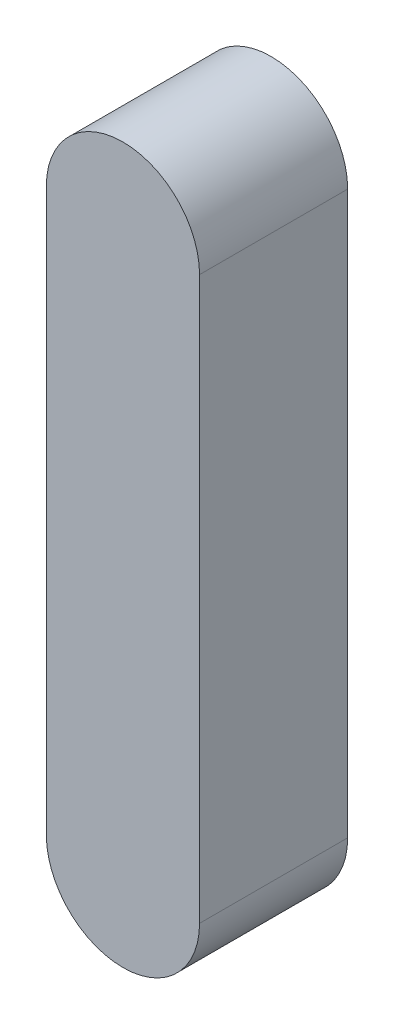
ISO-10303-21;
HEADER;
FILE_DESCRIPTION(('STEP AP214'),'2;1');
FILE_NAME('part.step','',(''),(''),'','','');
FILE_SCHEMA(('AUTOMOTIVE_DESIGN { 1 0 10303 214 1 1 1 1 }'));
ENDSEC;
DATA;
#1=APPLICATION_CONTEXT('core data for automotive mechanical design processes');
#2=APPLICATION_PROTOCOL_DEFINITION('international standard','automotive_design',2000,#1);
#3=PRODUCT_CONTEXT('',#1,'mechanical');
#4=PRODUCT('Part','Part','',(#3));
#5=PRODUCT_RELATED_PRODUCT_CATEGORY('part','',(#4));
#6=PRODUCT_DEFINITION_FORMATION('','',#4);
#7=PRODUCT_DEFINITION_CONTEXT('part definition',#1,'design');
#8=PRODUCT_DEFINITION('design','',#6,#7);
#9=PRODUCT_DEFINITION_SHAPE('','',#8);
#10=(LENGTH_UNIT() NAMED_UNIT(*) SI_UNIT(.MILLI.,.METRE.));
#11=(NAMED_UNIT(*) PLANE_ANGLE_UNIT() SI_UNIT($,.RADIAN.));
#12=(NAMED_UNIT(*) SI_UNIT($,.STERADIAN.) SOLID_ANGLE_UNIT());
#13=UNCERTAINTY_MEASURE_WITH_UNIT(LENGTH_MEASURE(1.E-05),#10,'distance_accuracy_value','');
#14=(GEOMETRIC_REPRESENTATION_CONTEXT(3) GLOBAL_UNCERTAINTY_ASSIGNED_CONTEXT((#13)) GLOBAL_UNIT_ASSIGNED_CONTEXT((#10,
#11,#12)) REPRESENTATION_CONTEXT('',''));
#15=CARTESIAN_POINT('',(0.,0.,0.));
#16=DIRECTION('',(0.,0.,1.));
#17=DIRECTION('',(1.,0.,0.));
#18=AXIS2_PLACEMENT_3D('',#15,#16,#17);
#19=CARTESIAN_POINT('',(-5.72755255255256,28.566041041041,2.9));
#20=DIRECTION('',(0.,0.,-1.));
#21=DIRECTION('',(-1.,0.,0.));
#22=AXIS2_PLACEMENT_3D('',#19,#20,#21);
#23=CYLINDRICAL_SURFACE('',#22,1.5);
#24=CARTESIAN_POINT('',(-5.72755255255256,28.566041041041,0.));
#25=DIRECTION('',(0.,0.,1.));
#26=DIRECTION('',(1.,0.,0.));
#27=AXIS2_PLACEMENT_3D('',#24,#25,#26);
#28=CIRCLE('',#27,1.5);
#29=CARTESIAN_POINT('',(-4.22755255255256,28.566041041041,0.));
#30=VERTEX_POINT('',#29);
#31=CARTESIAN_POINT('',(-7.22755255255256,28.566041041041,0.));
#32=VERTEX_POINT('',#31);
#33=EDGE_CURVE('E94',#30,#32,#28,.T.);
#34=ORIENTED_EDGE('',*,*,#33,.T.);
#35=DIRECTION('',(0.,0.,-1.));
#36=VECTOR('',#35,1.);
#37=CARTESIAN_POINT('',(-7.22755255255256,28.566041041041,2.9));
#38=LINE('',#37,#36);
#39=CARTESIAN_POINT('',(-7.22755255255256,28.566041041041,2.9));
#40=VERTEX_POINT('',#39);
#41=EDGE_CURVE('E11',#40,#32,#38,.T.);
#42=ORIENTED_EDGE('',*,*,#41,.F.);
#43=CARTESIAN_POINT('',(-5.72755255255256,28.566041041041,2.9));
#44=DIRECTION('',(0.,0.,1.));
#45=DIRECTION('',(1.,0.,0.));
#46=AXIS2_PLACEMENT_3D('',#43,#44,#45);
#47=CIRCLE('',#46,1.5);
#48=CARTESIAN_POINT('',(-4.22755255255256,28.566041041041,2.9));
#49=VERTEX_POINT('',#48);
#50=EDGE_CURVE('E82',#49,#40,#47,.T.);
#51=ORIENTED_EDGE('',*,*,#50,.F.);
#52=DIRECTION('',(0.,0.,-1.));
#53=VECTOR('',#52,1.);
#54=CARTESIAN_POINT('',(-4.22755255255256,28.566041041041,2.9));
#55=LINE('',#54,#53);
#56=EDGE_CURVE('E90',#49,#30,#55,.T.);
#57=ORIENTED_EDGE('',*,*,#56,.T.);
#58=EDGE_LOOP('',(#34,#42,#51,#57));
#59=FACE_BOUND('',#58,.T.);
#60=ADVANCED_FACE('F31',(#59),#23,.T.);
#61=CARTESIAN_POINT('',(-7.22755255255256,28.566041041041,2.9));
#62=DIRECTION('',(1.,0.,0.));
#63=DIRECTION('',(0.,1.,0.));
#64=AXIS2_PLACEMENT_3D('',#61,#62,#63);
#65=PLANE('',#64);
#66=DIRECTION('',(0.,-1.,0.));
#67=VECTOR('',#66,1.);
#68=CARTESIAN_POINT('',(-7.22755255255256,28.566041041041,0.));
#69=LINE('',#68,#67);
#70=CARTESIAN_POINT('',(-7.22755255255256,17.566041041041,0.));
#71=VERTEX_POINT('',#70);
#72=EDGE_CURVE('E86',#32,#71,#69,.T.);
#73=ORIENTED_EDGE('',*,*,#72,.T.);
#74=DIRECTION('',(0.,0.,-1.));
#75=VECTOR('',#74,1.);
#76=CARTESIAN_POINT('',(-7.22755255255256,17.566041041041,2.9));
#77=LINE('',#76,#75);
#78=CARTESIAN_POINT('',(-7.22755255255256,17.566041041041,2.9));
#79=VERTEX_POINT('',#78);
#80=EDGE_CURVE('E39',#79,#71,#77,.T.);
#81=ORIENTED_EDGE('',*,*,#80,.F.);
#82=DIRECTION('',(0.,-1.,0.));
#83=VECTOR('',#82,1.);
#84=CARTESIAN_POINT('',(-7.22755255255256,28.566041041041,2.9));
#85=LINE('',#84,#83);
#86=EDGE_CURVE('E77',#40,#79,#85,.T.);
#87=ORIENTED_EDGE('',*,*,#86,.F.);
#88=ORIENTED_EDGE('',*,*,#41,.T.);
#89=EDGE_LOOP('',(#73,#81,#87,#88));
#90=FACE_BOUND('',#89,.T.);
#91=ADVANCED_FACE('F85',(#90),#65,.F.);
#92=CARTESIAN_POINT('',(-5.72755255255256,17.566041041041,2.9));
#93=DIRECTION('',(0.,0.,-1.));
#94=DIRECTION('',(-1.,0.,0.));
#95=AXIS2_PLACEMENT_3D('',#92,#93,#94);
#96=CYLINDRICAL_SURFACE('',#95,1.5);
#97=CARTESIAN_POINT('',(-5.72755255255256,17.566041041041,0.));
#98=DIRECTION('',(0.,0.,1.));
#99=DIRECTION('',(1.,0.,0.));
#100=AXIS2_PLACEMENT_3D('',#97,#98,#99);
#101=CIRCLE('',#100,1.5);
#102=CARTESIAN_POINT('',(-4.22755255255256,17.566041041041,0.));
#103=VERTEX_POINT('',#102);
#104=EDGE_CURVE('E64',#71,#103,#101,.T.);
#105=ORIENTED_EDGE('',*,*,#104,.T.);
#106=DIRECTION('',(0.,0.,-1.));
#107=VECTOR('',#106,1.);
#108=CARTESIAN_POINT('',(-4.22755255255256,17.566041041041,2.9));
#109=LINE('',#108,#107);
#110=CARTESIAN_POINT('',(-4.22755255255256,17.566041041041,2.9));
#111=VERTEX_POINT('',#110);
#112=EDGE_CURVE('E87',#111,#103,#109,.T.);
#113=ORIENTED_EDGE('',*,*,#112,.F.);
#114=CARTESIAN_POINT('',(-5.72755255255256,17.566041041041,2.9));
#115=DIRECTION('',(0.,0.,1.));
#116=DIRECTION('',(1.,0.,0.));
#117=AXIS2_PLACEMENT_3D('',#114,#115,#116);
#118=CIRCLE('',#117,1.5);
#119=EDGE_CURVE('E80',#79,#111,#118,.T.);
#120=ORIENTED_EDGE('',*,*,#119,.F.);
#121=ORIENTED_EDGE('',*,*,#80,.T.);
#122=EDGE_LOOP('',(#105,#113,#120,#121));
#123=FACE_BOUND('',#122,.T.);
#124=ADVANCED_FACE('F88',(#123),#96,.T.);
#125=CARTESIAN_POINT('',(-4.22755255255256,28.566041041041,2.9));
#126=DIRECTION('',(-1.,0.,0.));
#127=DIRECTION('',(0.,-1.,0.));
#128=AXIS2_PLACEMENT_3D('',#125,#126,#127);
#129=PLANE('',#128);
#130=DIRECTION('',(0.,1.,0.));
#131=VECTOR('',#130,1.);
#132=CARTESIAN_POINT('',(-4.22755255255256,28.566041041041,0.));
#133=LINE('',#132,#131);
#134=EDGE_CURVE('E70',#103,#30,#133,.T.);
#135=ORIENTED_EDGE('',*,*,#134,.T.);
#136=ORIENTED_EDGE('',*,*,#56,.F.);
#137=DIRECTION('',(0.,1.,0.));
#138=VECTOR('',#137,1.);
#139=CARTESIAN_POINT('',(-4.22755255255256,28.566041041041,2.9));
#140=LINE('',#139,#138);
#141=EDGE_CURVE('E47',#111,#49,#140,.T.);
#142=ORIENTED_EDGE('',*,*,#141,.F.);
#143=ORIENTED_EDGE('',*,*,#112,.T.);
#144=EDGE_LOOP('',(#135,#136,#142,#143));
#145=FACE_BOUND('',#144,.T.);
#146=ADVANCED_FACE('F101',(#145),#129,.F.);
#147=CARTESIAN_POINT('',(-5.72755255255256,28.566041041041,2.9));
#148=DIRECTION('',(0.,0.,1.));
#149=DIRECTION('',(1.,0.,0.));
#150=AXIS2_PLACEMENT_3D('',#147,#148,#149);
#151=PLANE('',#150);
#152=ORIENTED_EDGE('',*,*,#50,.T.);
#153=ORIENTED_EDGE('',*,*,#86,.T.);
#154=ORIENTED_EDGE('',*,*,#119,.T.);
#155=ORIENTED_EDGE('',*,*,#141,.T.);
#156=EDGE_LOOP('',(#152,#153,#154,#155));
#157=FACE_BOUND('',#156,.T.);
#158=ADVANCED_FACE('F78',(#157),#151,.T.);
#159=CARTESIAN_POINT('',(-5.72755255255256,28.566041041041,0.));
#160=DIRECTION('',(0.,0.,1.));
#161=DIRECTION('',(1.,0.,0.));
#162=AXIS2_PLACEMENT_3D('',#159,#160,#161);
#163=PLANE('',#162);
#164=ORIENTED_EDGE('',*,*,#33,.F.);
#165=ORIENTED_EDGE('',*,*,#134,.F.);
#166=ORIENTED_EDGE('',*,*,#104,.F.);
#167=ORIENTED_EDGE('',*,*,#72,.F.);
#168=EDGE_LOOP('',(#164,#165,#166,#167));
#169=FACE_BOUND('',#168,.T.);
#170=ADVANCED_FACE('F104',(#169),#163,.F.);
#171=CLOSED_SHELL('',(#60,#91,#124,#146,#158,#170));
#172=MANIFOLD_SOLID_BREP('B2',#171);
#173=ADVANCED_BREP_SHAPE_REPRESENTATION('',(#18,#172),#14);
#174=SHAPE_DEFINITION_REPRESENTATION(#9,#173);
ENDSEC;
END-ISO-10303-21;
